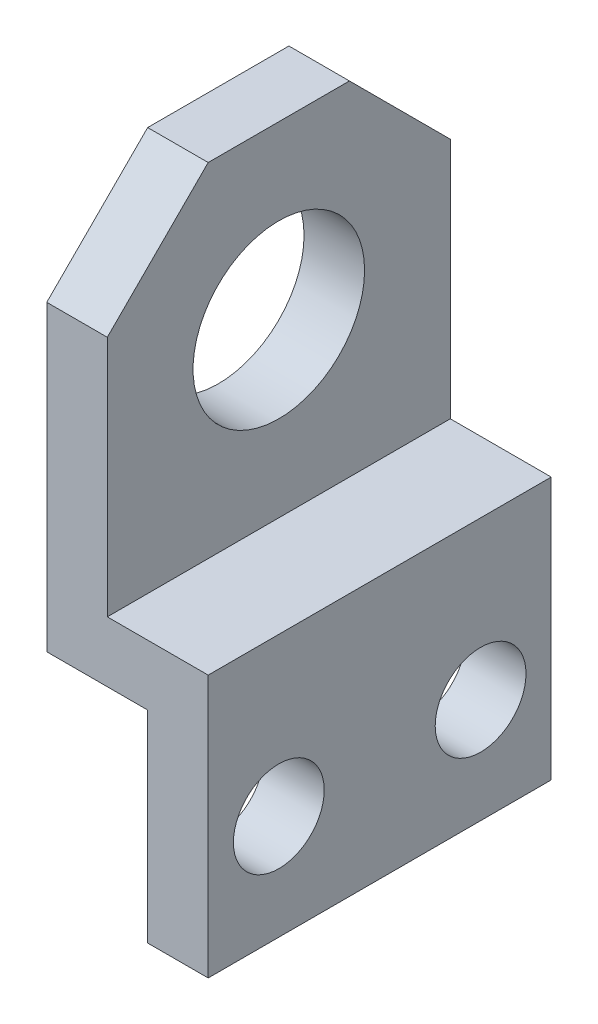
from build123d import *

# Parameters (mm, degrees)
EXTRU_MINCE1_DEPTH      = 8.5
CHANFREIN1_SIZE         = 5
ESQUISSE2_R             = 4.25
ENL_V_MAT_EXTRU_1_DEPTH = 10
ESQUISSE3_R             = 2.25
ENL_V_MAT_EXTRU_2_DEPTH = 10


with BuildPart() as part:
    # Esquisse1 → Extru.-Mince1 (new, symmetric)
    with BuildSketch(Plane.XY):
        Polygon((5, -10), (5, 0), (0, 0), (0, 20), (3, 20), (3, 3), (8, 3), (8, -10), align=None)
    extrude(amount=EXTRU_MINCE1_DEPTH, both=True)

    # Chanfrein1
    chanfrein1_edges = [part.edges().sort_by_distance(p)[0] for p in [
        (1.5, 20, 8.5),
        (1.5, 20, -8.5),
    ]]
    chamfer(chanfrein1_edges, length=CHANFREIN1_SIZE)

    # Esquisse2 → Enl_v. mat.-Extru.1 (cut)
    with BuildSketch(Plane(origin=(3, 0, 0), x_dir=(0, 0, -1), z_dir=(1, 0, 0))):
        with Locations((0, 11.5)):
            Circle(ESQUISSE2_R)
    extrude(amount=-ENL_V_MAT_EXTRU_1_DEPTH, mode=Mode.SUBTRACT)

    # Esquisse3 → Enl_v. mat.-Extru.2 (cut)
    with BuildSketch(Plane.ZY.offset(-5)):
        with Locations(Location((-5, -4.808756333, 0), (0, 0, 270))):
            Circle(ESQUISSE3_R)
        with Locations(Location((5, -4.808756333, 0), (0, 0, 270))):
            Circle(ESQUISSE3_R)
    extrude(amount=-ENL_V_MAT_EXTRU_2_DEPTH, mode=Mode.SUBTRACT)


solid = part.part
